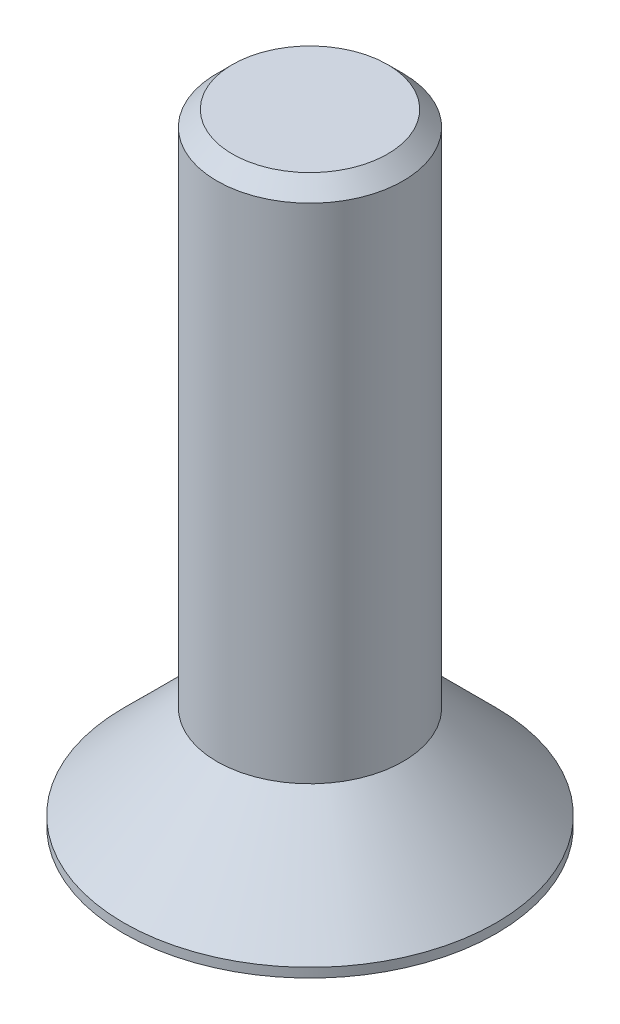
from build123d import *

# Parameters (mm, degrees)
CHANFREIN1_SIZE         = 0.5
ENL_V_MAT_EXTRU_1_DEPTH = 2


with BuildPart() as part:
    # Esquisse1 → R_volution1 (revolve)
    with BuildSketch(Plane.XY, mode=Mode.PRIVATE) as r_volution1_sk:
        Polygon((0, 0), (-6, 0), (-6, 0.3), (-3, 3.3), (-3, 20), (0, 20), align=None)
    revolve(r_volution1_sk.sketch.rotate(Axis((0, 0, 0), (0, 1, 0)), 270), axis=Axis((0, 0, 0), (0, 1, 0)))

    # Chanfrein1
    chanfrein1_edges = [part.edges().sort_by_distance(p)[0] for p in [
        (0, 20, 3),
    ]]
    chamfer(chanfrein1_edges, length=CHANFREIN1_SIZE)

    # Esquisse3 → Enl_v. mat.-Extru.1 (cut)
    with BuildSketch(Plane.XZ):
        Polygon((2, 1.154700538), (0, 2.309401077), (-2, 1.154700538), (-2, -1.154700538), (0, -2.309401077), (2, -1.154700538), align=None)
    extrude(amount=-ENL_V_MAT_EXTRU_1_DEPTH, mode=Mode.SUBTRACT)


solid = part.part
